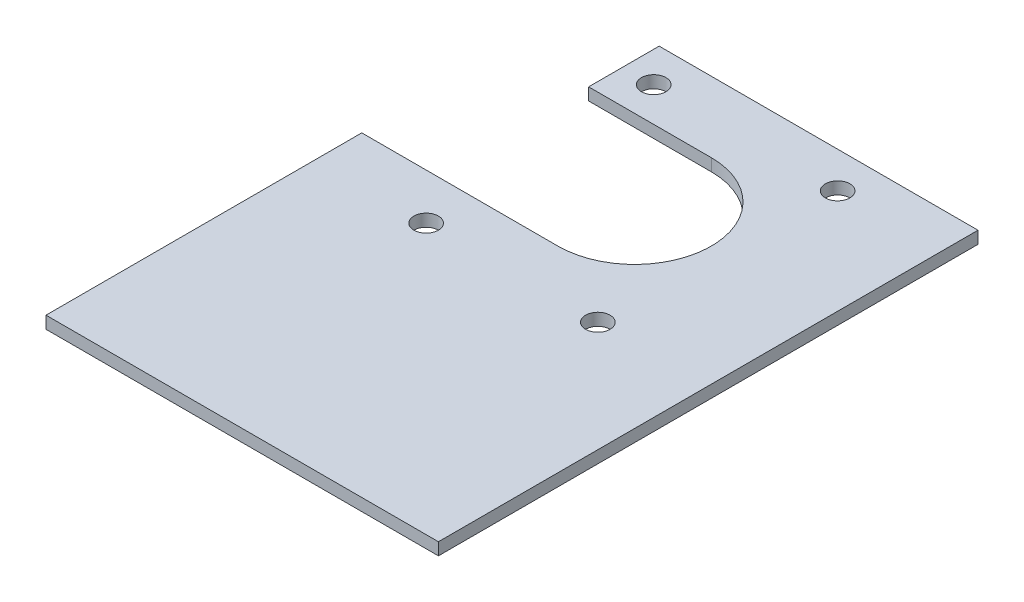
ISO-10303-21;
HEADER;
FILE_DESCRIPTION(('STEP AP214'),'2;1');
FILE_NAME('part.step','',(''),(''),'','','');
FILE_SCHEMA(('AUTOMOTIVE_DESIGN { 1 0 10303 214 1 1 1 1 }'));
ENDSEC;
DATA;
#1=APPLICATION_CONTEXT('core data for automotive mechanical design processes');
#2=APPLICATION_PROTOCOL_DEFINITION('international standard','automotive_design',2000,#1);
#3=PRODUCT_CONTEXT('',#1,'mechanical');
#4=PRODUCT('Part','Part','',(#3));
#5=PRODUCT_RELATED_PRODUCT_CATEGORY('part','',(#4));
#6=PRODUCT_DEFINITION_FORMATION('','',#4);
#7=PRODUCT_DEFINITION_CONTEXT('part definition',#1,'design');
#8=PRODUCT_DEFINITION('design','',#6,#7);
#9=PRODUCT_DEFINITION_SHAPE('','',#8);
#10=(LENGTH_UNIT() NAMED_UNIT(*) SI_UNIT(.MILLI.,.METRE.));
#11=(NAMED_UNIT(*) PLANE_ANGLE_UNIT() SI_UNIT($,.RADIAN.));
#12=(NAMED_UNIT(*) SI_UNIT($,.STERADIAN.) SOLID_ANGLE_UNIT());
#13=UNCERTAINTY_MEASURE_WITH_UNIT(LENGTH_MEASURE(1.E-05),#10,'distance_accuracy_value','');
#14=(GEOMETRIC_REPRESENTATION_CONTEXT(3) GLOBAL_UNCERTAINTY_ASSIGNED_CONTEXT((#13)) GLOBAL_UNIT_ASSIGNED_CONTEXT((#10,
#11,#12)) REPRESENTATION_CONTEXT('',''));
#15=CARTESIAN_POINT('',(0.,0.,0.));
#16=DIRECTION('',(0.,0.,1.));
#17=DIRECTION('',(1.,0.,0.));
#18=AXIS2_PLACEMENT_3D('',#15,#16,#17);
#19=CARTESIAN_POINT('',(25.4,1.5875,-19.05));
#20=DIRECTION('',(-1.,0.,0.));
#21=DIRECTION('',(0.,0.,1.));
#22=AXIS2_PLACEMENT_3D('',#19,#20,#21);
#23=PLANE('',#22);
#24=DIRECTION('',(0.,0.,-1.));
#25=VECTOR('',#24,1.);
#26=CARTESIAN_POINT('',(25.4,0.,-19.05));
#27=LINE('',#26,#25);
#28=CARTESIAN_POINT('',(25.4,0.,50.8));
#29=VERTEX_POINT('',#28);
#30=CARTESIAN_POINT('',(25.4,0.,-19.05));
#31=VERTEX_POINT('',#30);
#32=EDGE_CURVE('E128',#29,#31,#27,.T.);
#33=ORIENTED_EDGE('',*,*,#32,.T.);
#34=DIRECTION('',(0.,-1.,0.));
#35=VECTOR('',#34,1.);
#36=CARTESIAN_POINT('',(25.4,1.5875,-19.05));
#37=LINE('',#36,#35);
#38=CARTESIAN_POINT('',(25.4,1.5875,-19.05));
#39=VERTEX_POINT('',#38);
#40=EDGE_CURVE('E11',#39,#31,#37,.T.);
#41=ORIENTED_EDGE('',*,*,#40,.F.);
#42=DIRECTION('',(0.,0.,-1.));
#43=VECTOR('',#42,1.);
#44=CARTESIAN_POINT('',(25.4,1.5875,-19.05));
#45=LINE('',#44,#43);
#46=CARTESIAN_POINT('',(25.4,1.5875,50.8));
#47=VERTEX_POINT('',#46);
#48=EDGE_CURVE('E144',#47,#39,#45,.T.);
#49=ORIENTED_EDGE('',*,*,#48,.F.);
#50=DIRECTION('',(0.,-1.,0.));
#51=VECTOR('',#50,1.);
#52=CARTESIAN_POINT('',(25.4,1.5875,50.8));
#53=LINE('',#52,#51);
#54=EDGE_CURVE('E124',#47,#29,#53,.T.);
#55=ORIENTED_EDGE('',*,*,#54,.T.);
#56=EDGE_LOOP('',(#33,#41,#49,#55));
#57=FACE_BOUND('',#56,.T.);
#58=ADVANCED_FACE('F32',(#57),#23,.F.);
#59=CARTESIAN_POINT('',(25.4,1.5875,-19.05));
#60=DIRECTION('',(0.,0.,1.));
#61=DIRECTION('',(1.,0.,0.));
#62=AXIS2_PLACEMENT_3D('',#59,#60,#61);
#63=PLANE('',#62);
#64=DIRECTION('',(-1.,0.,0.));
#65=VECTOR('',#64,1.);
#66=CARTESIAN_POINT('',(25.4,0.,-19.05));
#67=LINE('',#66,#65);
#68=CARTESIAN_POINT('',(-15.875,0.,-19.05));
#69=VERTEX_POINT('',#68);
#70=EDGE_CURVE('E131',#31,#69,#67,.T.);
#71=ORIENTED_EDGE('',*,*,#70,.T.);
#72=DIRECTION('',(0.,-1.,0.));
#73=VECTOR('',#72,1.);
#74=CARTESIAN_POINT('',(-15.875,1.5875,-19.05));
#75=LINE('',#74,#73);
#76=CARTESIAN_POINT('',(-15.875,1.5875,-19.05));
#77=VERTEX_POINT('',#76);
#78=EDGE_CURVE('E40',#77,#69,#75,.T.);
#79=ORIENTED_EDGE('',*,*,#78,.F.);
#80=DIRECTION('',(-1.,0.,0.));
#81=VECTOR('',#80,1.);
#82=CARTESIAN_POINT('',(25.4,1.5875,-19.05));
#83=LINE('',#82,#81);
#84=EDGE_CURVE('E91',#39,#77,#83,.T.);
#85=ORIENTED_EDGE('',*,*,#84,.F.);
#86=ORIENTED_EDGE('',*,*,#40,.T.);
#87=EDGE_LOOP('',(#71,#79,#85,#86));
#88=FACE_BOUND('',#87,.T.);
#89=ADVANCED_FACE('F233',(#88),#63,.F.);
#90=CARTESIAN_POINT('',(-15.875,1.5875,-9.921875));
#91=DIRECTION('',(1.,0.,0.));
#92=DIRECTION('',(0.,0.,-1.));
#93=AXIS2_PLACEMENT_3D('',#90,#91,#92);
#94=PLANE('',#93);
#95=DIRECTION('',(0.,0.,1.));
#96=VECTOR('',#95,1.);
#97=CARTESIAN_POINT('',(-15.875,0.,-9.921875));
#98=LINE('',#97,#96);
#99=CARTESIAN_POINT('',(-15.875,0.,-9.921875));
#100=VERTEX_POINT('',#99);
#101=EDGE_CURVE('E134',#69,#100,#98,.T.);
#102=ORIENTED_EDGE('',*,*,#101,.T.);
#103=DIRECTION('',(0.,-1.,0.));
#104=VECTOR('',#103,1.);
#105=CARTESIAN_POINT('',(-15.875,1.5875,-9.921875));
#106=LINE('',#105,#104);
#107=CARTESIAN_POINT('',(-15.875,1.5875,-9.921875));
#108=VERTEX_POINT('',#107);
#109=EDGE_CURVE('E151',#108,#100,#106,.T.);
#110=ORIENTED_EDGE('',*,*,#109,.F.);
#111=DIRECTION('',(0.,0.,1.));
#112=VECTOR('',#111,1.);
#113=CARTESIAN_POINT('',(-15.875,1.5875,-9.921875));
#114=LINE('',#113,#112);
#115=EDGE_CURVE('E159',#77,#108,#114,.T.);
#116=ORIENTED_EDGE('',*,*,#115,.F.);
#117=ORIENTED_EDGE('',*,*,#78,.T.);
#118=EDGE_LOOP('',(#102,#110,#116,#117));
#119=FACE_BOUND('',#118,.T.);
#120=ADVANCED_FACE('F157',(#119),#94,.F.);
#121=CARTESIAN_POINT('',(0.,1.5875,-9.921875));
#122=DIRECTION('',(0.,0.,-1.));
#123=DIRECTION('',(-1.,0.,0.));
#124=AXIS2_PLACEMENT_3D('',#121,#122,#123);
#125=PLANE('',#124);
#126=DIRECTION('',(1.,0.,0.));
#127=VECTOR('',#126,1.);
#128=CARTESIAN_POINT('',(0.,0.,-9.921875));
#129=LINE('',#128,#127);
#130=CARTESIAN_POINT('',(0.,0.,-9.921875));
#131=VERTEX_POINT('',#130);
#132=EDGE_CURVE('E136',#100,#131,#129,.T.);
#133=ORIENTED_EDGE('',*,*,#132,.T.);
#134=DIRECTION('',(0.,-1.,0.));
#135=VECTOR('',#134,1.);
#136=CARTESIAN_POINT('',(0.,1.5875,-9.921875));
#137=LINE('',#136,#135);
#138=CARTESIAN_POINT('',(0.,1.5875,-9.921875));
#139=VERTEX_POINT('',#138);
#140=EDGE_CURVE('E148',#139,#131,#137,.T.);
#141=ORIENTED_EDGE('',*,*,#140,.F.);
#142=DIRECTION('',(1.,0.,0.));
#143=VECTOR('',#142,1.);
#144=CARTESIAN_POINT('',(0.,1.5875,-9.921875));
#145=LINE('',#144,#143);
#146=EDGE_CURVE('E170',#108,#139,#145,.T.);
#147=ORIENTED_EDGE('',*,*,#146,.F.);
#148=ORIENTED_EDGE('',*,*,#109,.T.);
#149=EDGE_LOOP('',(#133,#141,#147,#148));
#150=FACE_BOUND('',#149,.T.);
#151=ADVANCED_FACE('F166',(#150),#125,.F.);
#152=CARTESIAN_POINT('',(0.,1.5875,0.));
#153=DIRECTION('',(0.,-1.,0.));
#154=DIRECTION('',(0.,0.,-1.));
#155=AXIS2_PLACEMENT_3D('',#152,#153,#154);
#156=CYLINDRICAL_SURFACE('',#155,9.921875);
#157=CARTESIAN_POINT('',(0.,0.,0.));
#158=DIRECTION('',(0.,-1.,0.));
#159=DIRECTION('',(0.,0.,1.));
#160=AXIS2_PLACEMENT_3D('',#157,#158,#159);
#161=CIRCLE('',#160,9.921875);
#162=CARTESIAN_POINT('',(0.,0.,9.921875));
#163=VERTEX_POINT('',#162);
#164=EDGE_CURVE('E139',#131,#163,#161,.T.);
#165=ORIENTED_EDGE('',*,*,#164,.T.);
#166=DIRECTION('',(0.,-1.,0.));
#167=VECTOR('',#166,1.);
#168=CARTESIAN_POINT('',(0.,1.5875,9.921875));
#169=LINE('',#168,#167);
#170=CARTESIAN_POINT('',(0.,1.5875,9.921875));
#171=VERTEX_POINT('',#170);
#172=EDGE_CURVE('E119',#171,#163,#169,.T.);
#173=ORIENTED_EDGE('',*,*,#172,.F.);
#174=CARTESIAN_POINT('',(0.,1.5875,0.));
#175=DIRECTION('',(0.,-1.,0.));
#176=DIRECTION('',(0.,0.,1.));
#177=AXIS2_PLACEMENT_3D('',#174,#175,#176);
#178=CIRCLE('',#177,9.921875);
#179=EDGE_CURVE('E110',#139,#171,#178,.T.);
#180=ORIENTED_EDGE('',*,*,#179,.F.);
#181=ORIENTED_EDGE('',*,*,#140,.T.);
#182=EDGE_LOOP('',(#165,#173,#180,#181));
#183=FACE_BOUND('',#182,.T.);
#184=ADVANCED_FACE('F169',(#183),#156,.F.);
#185=CARTESIAN_POINT('',(0.,1.5875,9.921875));
#186=DIRECTION('',(0.,0.,1.));
#187=DIRECTION('',(1.,0.,0.));
#188=AXIS2_PLACEMENT_3D('',#185,#186,#187);
#189=PLANE('',#188);
#190=DIRECTION('',(-1.,0.,0.));
#191=VECTOR('',#190,1.);
#192=CARTESIAN_POINT('',(0.,0.,9.921875));
#193=LINE('',#192,#191);
#194=CARTESIAN_POINT('',(-25.4,0.,9.92187500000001));
#195=VERTEX_POINT('',#194);
#196=EDGE_CURVE('E118',#163,#195,#193,.T.);
#197=ORIENTED_EDGE('',*,*,#196,.T.);
#198=DIRECTION('',(0.,-1.,0.));
#199=VECTOR('',#198,1.);
#200=CARTESIAN_POINT('',(-25.4,1.5875,9.92187500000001));
#201=LINE('',#200,#199);
#202=CARTESIAN_POINT('',(-25.4,1.5875,9.92187500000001));
#203=VERTEX_POINT('',#202);
#204=EDGE_CURVE('E115',#203,#195,#201,.T.);
#205=ORIENTED_EDGE('',*,*,#204,.F.);
#206=DIRECTION('',(-1.,0.,0.));
#207=VECTOR('',#206,1.);
#208=CARTESIAN_POINT('',(0.,1.5875,9.921875));
#209=LINE('',#208,#207);
#210=EDGE_CURVE('E104',#171,#203,#209,.T.);
#211=ORIENTED_EDGE('',*,*,#210,.F.);
#212=ORIENTED_EDGE('',*,*,#172,.T.);
#213=EDGE_LOOP('',(#197,#205,#211,#212));
#214=FACE_BOUND('',#213,.T.);
#215=ADVANCED_FACE('F116',(#214),#189,.F.);
#216=CARTESIAN_POINT('',(-25.4,1.5875,9.92187500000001));
#217=DIRECTION('',(1.,0.,0.));
#218=DIRECTION('',(0.,0.,-1.));
#219=AXIS2_PLACEMENT_3D('',#216,#217,#218);
#220=PLANE('',#219);
#221=DIRECTION('',(0.,0.,1.));
#222=VECTOR('',#221,1.);
#223=CARTESIAN_POINT('',(-25.4,0.,9.92187500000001));
#224=LINE('',#223,#222);
#225=CARTESIAN_POINT('',(-25.4,0.,50.8));
#226=VERTEX_POINT('',#225);
#227=EDGE_CURVE('E77',#195,#226,#224,.T.);
#228=ORIENTED_EDGE('',*,*,#227,.T.);
#229=DIRECTION('',(0.,-1.,0.));
#230=VECTOR('',#229,1.);
#231=CARTESIAN_POINT('',(-25.4,1.5875,50.8));
#232=LINE('',#231,#230);
#233=CARTESIAN_POINT('',(-25.4,1.5875,50.8));
#234=VERTEX_POINT('',#233);
#235=EDGE_CURVE('E120',#234,#226,#232,.T.);
#236=ORIENTED_EDGE('',*,*,#235,.F.);
#237=DIRECTION('',(0.,0.,1.));
#238=VECTOR('',#237,1.);
#239=CARTESIAN_POINT('',(-25.4,1.5875,9.92187500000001));
#240=LINE('',#239,#238);
#241=EDGE_CURVE('E108',#203,#234,#240,.T.);
#242=ORIENTED_EDGE('',*,*,#241,.F.);
#243=ORIENTED_EDGE('',*,*,#204,.T.);
#244=EDGE_LOOP('',(#228,#236,#242,#243));
#245=FACE_BOUND('',#244,.T.);
#246=ADVANCED_FACE('F122',(#245),#220,.F.);
#247=CARTESIAN_POINT('',(-25.4,1.5875,50.8));
#248=DIRECTION('',(0.,0.,-1.));
#249=DIRECTION('',(-1.,0.,0.));
#250=AXIS2_PLACEMENT_3D('',#247,#248,#249);
#251=PLANE('',#250);
#252=DIRECTION('',(1.,0.,0.));
#253=VECTOR('',#252,1.);
#254=CARTESIAN_POINT('',(-25.4,0.,50.8));
#255=LINE('',#254,#253);
#256=EDGE_CURVE('E83',#226,#29,#255,.T.);
#257=ORIENTED_EDGE('',*,*,#256,.T.);
#258=ORIENTED_EDGE('',*,*,#54,.F.);
#259=DIRECTION('',(1.,0.,0.));
#260=VECTOR('',#259,1.);
#261=CARTESIAN_POINT('',(-25.4,1.5875,50.8));
#262=LINE('',#261,#260);
#263=EDGE_CURVE('E48',#234,#47,#262,.T.);
#264=ORIENTED_EDGE('',*,*,#263,.F.);
#265=ORIENTED_EDGE('',*,*,#235,.T.);
#266=EDGE_LOOP('',(#257,#258,#264,#265));
#267=FACE_BOUND('',#266,.T.);
#268=ADVANCED_FACE('F211',(#267),#251,.F.);
#269=CARTESIAN_POINT('',(0.,1.5875,0.));
#270=DIRECTION('',(0.,1.,0.));
#271=DIRECTION('',(0.,0.,1.));
#272=AXIS2_PLACEMENT_3D('',#269,#270,#271);
#273=PLANE('',#272);
#274=CARTESIAN_POINT('',(-11.1125,1.5875,15.875));
#275=DIRECTION('',(0.,1.,0.));
#276=DIRECTION('',(0.,0.,1.));
#277=AXIS2_PLACEMENT_3D('',#274,#275,#276);
#278=CIRCLE('',#277,1.5875);
#279=CARTESIAN_POINT('',(-11.1125,1.5875,17.4625));
#280=VERTEX_POINT('',#279);
#281=EDGE_CURVE('E194',#280,#280,#278,.T.);
#282=ORIENTED_EDGE('',*,*,#281,.F.);
#283=EDGE_LOOP('',(#282));
#284=FACE_BOUND('',#283,.T.);
#285=CARTESIAN_POINT('',(11.1125,1.5875,15.875));
#286=DIRECTION('',(0.,1.,0.));
#287=DIRECTION('',(0.,0.,1.));
#288=AXIS2_PLACEMENT_3D('',#285,#286,#287);
#289=CIRCLE('',#288,1.5875);
#290=CARTESIAN_POINT('',(11.1125,1.5875,17.4625));
#291=VERTEX_POINT('',#290);
#292=EDGE_CURVE('E188',#291,#291,#289,.T.);
#293=ORIENTED_EDGE('',*,*,#292,.F.);
#294=EDGE_LOOP('',(#293));
#295=FACE_BOUND('',#294,.T.);
#296=CARTESIAN_POINT('',(-11.90625,1.5875,-14.3764));
#297=DIRECTION('',(0.,1.,0.));
#298=DIRECTION('',(0.,0.,1.));
#299=AXIS2_PLACEMENT_3D('',#296,#297,#298);
#300=CIRCLE('',#299,1.5875);
#301=CARTESIAN_POINT('',(-11.90625,1.5875,-12.7889));
#302=VERTEX_POINT('',#301);
#303=EDGE_CURVE('E182',#302,#302,#300,.T.);
#304=ORIENTED_EDGE('',*,*,#303,.F.);
#305=EDGE_LOOP('',(#304));
#306=FACE_BOUND('',#305,.T.);
#307=CARTESIAN_POINT('',(11.90625,1.5875,-14.3764));
#308=DIRECTION('',(0.,1.,0.));
#309=DIRECTION('',(0.,0.,1.));
#310=AXIS2_PLACEMENT_3D('',#307,#308,#309);
#311=CIRCLE('',#310,1.5875);
#312=CARTESIAN_POINT('',(11.90625,1.5875,-12.7889));
#313=VERTEX_POINT('',#312);
#314=EDGE_CURVE('E176',#313,#313,#311,.T.);
#315=ORIENTED_EDGE('',*,*,#314,.F.);
#316=EDGE_LOOP('',(#315));
#317=FACE_BOUND('',#316,.T.);
#318=ORIENTED_EDGE('',*,*,#48,.T.);
#319=ORIENTED_EDGE('',*,*,#84,.T.);
#320=ORIENTED_EDGE('',*,*,#115,.T.);
#321=ORIENTED_EDGE('',*,*,#146,.T.);
#322=ORIENTED_EDGE('',*,*,#179,.T.);
#323=ORIENTED_EDGE('',*,*,#210,.T.);
#324=ORIENTED_EDGE('',*,*,#241,.T.);
#325=ORIENTED_EDGE('',*,*,#263,.T.);
#326=EDGE_LOOP('',(#318,#319,#320,#321,#322,#323,#324,#325));
#327=FACE_BOUND('',#326,.T.);
#328=ADVANCED_FACE('F106',(#284,#295,#306,#317,#327),#273,.T.);
#329=CARTESIAN_POINT('',(0.,0.,0.));
#330=DIRECTION('',(0.,1.,0.));
#331=DIRECTION('',(0.,0.,1.));
#332=AXIS2_PLACEMENT_3D('',#329,#330,#331);
#333=PLANE('',#332);
#334=CARTESIAN_POINT('',(-11.1125,0.,15.875));
#335=DIRECTION('',(0.,1.,0.));
#336=DIRECTION('',(0.,0.,1.));
#337=AXIS2_PLACEMENT_3D('',#334,#335,#336);
#338=CIRCLE('',#337,1.5875);
#339=CARTESIAN_POINT('',(-11.1125,0.,17.4625));
#340=VERTEX_POINT('',#339);
#341=EDGE_CURVE('E191',#340,#340,#338,.T.);
#342=ORIENTED_EDGE('',*,*,#341,.T.);
#343=EDGE_LOOP('',(#342));
#344=FACE_BOUND('',#343,.T.);
#345=CARTESIAN_POINT('',(11.1125,0.,15.875));
#346=DIRECTION('',(0.,1.,0.));
#347=DIRECTION('',(0.,0.,1.));
#348=AXIS2_PLACEMENT_3D('',#345,#346,#347);
#349=CIRCLE('',#348,1.5875);
#350=CARTESIAN_POINT('',(11.1125,0.,17.4625));
#351=VERTEX_POINT('',#350);
#352=EDGE_CURVE('E185',#351,#351,#349,.T.);
#353=ORIENTED_EDGE('',*,*,#352,.T.);
#354=EDGE_LOOP('',(#353));
#355=FACE_BOUND('',#354,.T.);
#356=CARTESIAN_POINT('',(-11.90625,0.,-14.3764));
#357=DIRECTION('',(0.,1.,0.));
#358=DIRECTION('',(0.,0.,1.));
#359=AXIS2_PLACEMENT_3D('',#356,#357,#358);
#360=CIRCLE('',#359,1.5875);
#361=CARTESIAN_POINT('',(-11.90625,0.,-12.7889));
#362=VERTEX_POINT('',#361);
#363=EDGE_CURVE('E179',#362,#362,#360,.T.);
#364=ORIENTED_EDGE('',*,*,#363,.T.);
#365=EDGE_LOOP('',(#364));
#366=FACE_BOUND('',#365,.T.);
#367=CARTESIAN_POINT('',(11.90625,0.,-14.3764));
#368=DIRECTION('',(0.,1.,0.));
#369=DIRECTION('',(0.,0.,1.));
#370=AXIS2_PLACEMENT_3D('',#367,#368,#369);
#371=CIRCLE('',#370,1.5875);
#372=CARTESIAN_POINT('',(11.90625,0.,-12.7889));
#373=VERTEX_POINT('',#372);
#374=EDGE_CURVE('E132',#373,#373,#371,.T.);
#375=ORIENTED_EDGE('',*,*,#374,.T.);
#376=EDGE_LOOP('',(#375));
#377=FACE_BOUND('',#376,.T.);
#378=ORIENTED_EDGE('',*,*,#32,.F.);
#379=ORIENTED_EDGE('',*,*,#256,.F.);
#380=ORIENTED_EDGE('',*,*,#227,.F.);
#381=ORIENTED_EDGE('',*,*,#196,.F.);
#382=ORIENTED_EDGE('',*,*,#164,.F.);
#383=ORIENTED_EDGE('',*,*,#132,.F.);
#384=ORIENTED_EDGE('',*,*,#101,.F.);
#385=ORIENTED_EDGE('',*,*,#70,.F.);
#386=EDGE_LOOP('',(#378,#379,#380,#381,#382,#383,#384,#385));
#387=FACE_BOUND('',#386,.T.);
#388=ADVANCED_FACE('F163',(#344,#355,#366,#377,#387),#333,.F.);
#389=CARTESIAN_POINT('',(11.90625,0.,-14.3764));
#390=DIRECTION('',(0.,1.,0.));
#391=DIRECTION('',(0.,0.,1.));
#392=AXIS2_PLACEMENT_3D('',#389,#390,#391);
#393=CYLINDRICAL_SURFACE('',#392,1.5875);
#394=ORIENTED_EDGE('',*,*,#374,.F.);
#395=EDGE_LOOP('',(#394));
#396=FACE_BOUND('',#395,.T.);
#397=ORIENTED_EDGE('',*,*,#314,.T.);
#398=EDGE_LOOP('',(#397));
#399=FACE_BOUND('',#398,.T.);
#400=ADVANCED_FACE('F219',(#396,#399),#393,.F.);
#401=CARTESIAN_POINT('',(-11.90625,0.,-14.3764));
#402=DIRECTION('',(0.,1.,0.));
#403=DIRECTION('',(0.,0.,1.));
#404=AXIS2_PLACEMENT_3D('',#401,#402,#403);
#405=CYLINDRICAL_SURFACE('',#404,1.5875);
#406=ORIENTED_EDGE('',*,*,#363,.F.);
#407=EDGE_LOOP('',(#406));
#408=FACE_BOUND('',#407,.T.);
#409=ORIENTED_EDGE('',*,*,#303,.T.);
#410=EDGE_LOOP('',(#409));
#411=FACE_BOUND('',#410,.T.);
#412=ADVANCED_FACE('F221',(#408,#411),#405,.F.);
#413=CARTESIAN_POINT('',(11.1125,0.,15.875));
#414=DIRECTION('',(0.,1.,0.));
#415=DIRECTION('',(0.,0.,1.));
#416=AXIS2_PLACEMENT_3D('',#413,#414,#415);
#417=CYLINDRICAL_SURFACE('',#416,1.5875);
#418=ORIENTED_EDGE('',*,*,#352,.F.);
#419=EDGE_LOOP('',(#418));
#420=FACE_BOUND('',#419,.T.);
#421=ORIENTED_EDGE('',*,*,#292,.T.);
#422=EDGE_LOOP('',(#421));
#423=FACE_BOUND('',#422,.T.);
#424=ADVANCED_FACE('F205',(#420,#423),#417,.F.);
#425=CARTESIAN_POINT('',(-11.1125,0.,15.875));
#426=DIRECTION('',(0.,1.,0.));
#427=DIRECTION('',(0.,0.,1.));
#428=AXIS2_PLACEMENT_3D('',#425,#426,#427);
#429=CYLINDRICAL_SURFACE('',#428,1.5875);
#430=ORIENTED_EDGE('',*,*,#341,.F.);
#431=EDGE_LOOP('',(#430));
#432=FACE_BOUND('',#431,.T.);
#433=ORIENTED_EDGE('',*,*,#281,.T.);
#434=EDGE_LOOP('',(#433));
#435=FACE_BOUND('',#434,.T.);
#436=ADVANCED_FACE('F202',(#432,#435),#429,.F.);
#437=CLOSED_SHELL('',(#58,#89,#120,#151,#184,#215,#246,#268,#328,#388,#400,#412,#424,#436));
#438=MANIFOLD_SOLID_BREP('B2',#437);
#439=ADVANCED_BREP_SHAPE_REPRESENTATION('',(#18,#438),#14);
#440=SHAPE_DEFINITION_REPRESENTATION(#9,#439);
ENDSEC;
END-ISO-10303-21;
